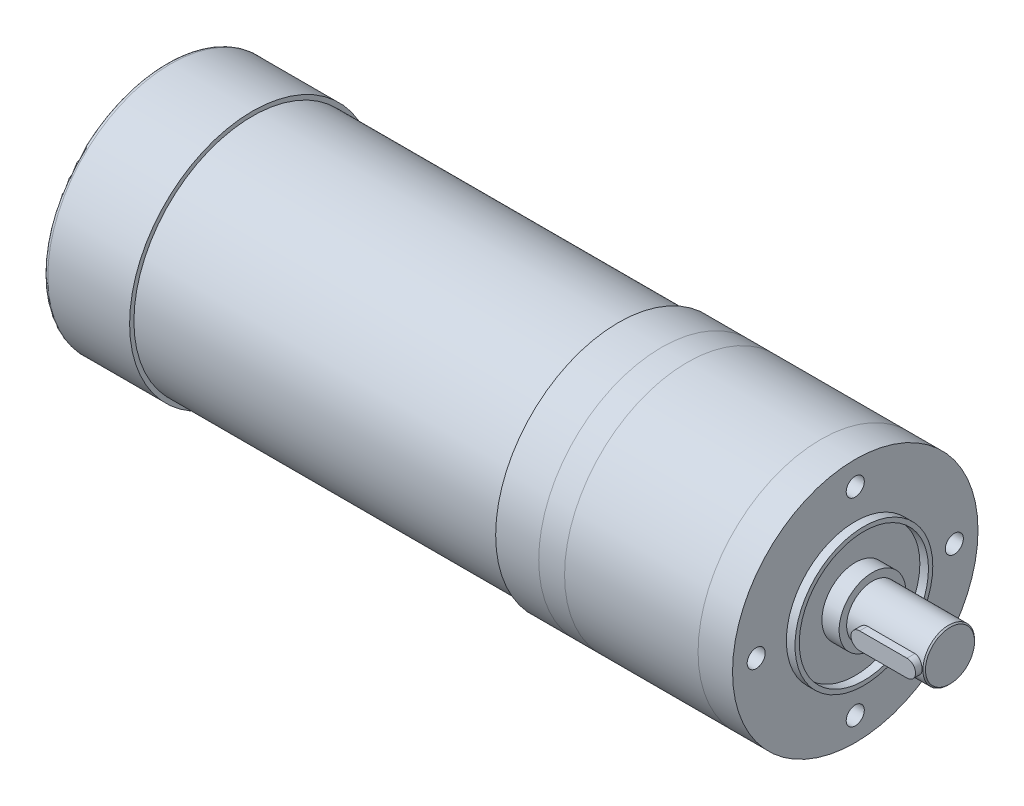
from build123d import *

# Parameters (mm, degrees)
SKETCH_1_R                  = 28.5
EXTRUDE_1_DEPTH             = 8
SKETCH_2_R                  = 28.5
EXTRUDE_2_DEPTH             = 31
SKETCH_3_R                  = 28.5
EXTRUDE_3_DEPTH             = 6
SKETCH_4_R                  = 28.5
EXTRUDE_4_DEPTH             = 10
SKETCH_5_R                  = 27.5
EXTRUDE_5_DEPTH             = 85
SKETCH_6_R                  = 28.5
EXTRUDE_6_DEPTH             = 20
FILLET_1_R                  = 1
SKETCH_7_R                  = 16
SKETCH_7_R_2                = 15
EXTRUDE_7_DEPTH             = 2
SKETCH_8_R                  = 7.75
EXTRUDE_8_DEPTH             = 4
SKETCH_9_R                  = 6
EXTRUDE_9_DEPTH             = 18
HOLE_WIZARD_M5_1_AT_2_COUNT = 2
HOLE_WIZARD_M5_1_AT_2_PITCH = 32.526911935
HOLE_WIZARD_M5_1_AT_3_COUNT = 2
HOLE_WIZARD_M5_1_AT_3_PITCH = 46
HOLE_WIZARD_M5_1_AT_4_COUNT = 2
HOLE_WIZARD_M5_1_AT_4_PITCH = 32.526911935
CUT_EXTRUDE_1_DEPTH         = 2.5
EXTRUDE_10_DEPTH            = 4
CHAMFER_1_SIZE              = 0.3


with BuildPart() as part:
    # Sketch 1 → Extrude 1 (new body)
    with BuildSketch(Plane(origin=(0, 0, 0), x_dir=(0, 0, -1), z_dir=(1, 0, 0))):
        Circle(SKETCH_1_R)
    extrude(amount=-EXTRUDE_1_DEPTH)

    # Sketch 7 → Extrude 7 (add)
    with BuildSketch(Plane(origin=(0, 0, 0), x_dir=(0, 0, -1), z_dir=(1, 0, 0))):
        Circle(SKETCH_7_R)
        Circle(SKETCH_7_R_2, mode=Mode.SUBTRACT)
    extrude(amount=EXTRUDE_7_DEPTH)

    # Sketch 8 → Extrude 8 (add)
    with BuildSketch(Plane(origin=(0, 0, 0), x_dir=(0, 0, -1), z_dir=(1, 0, 0))):
        Circle(SKETCH_8_R)
    extrude(amount=EXTRUDE_8_DEPTH)

    # Sketch 9 → Extrude 9 (add)
    with BuildSketch(Plane(origin=(4, 0, 0), x_dir=(0, 0, -1), z_dir=(1, 0, 0))):
        Circle(SKETCH_9_R)
    extrude(amount=EXTRUDE_9_DEPTH)


with BuildPart() as body_2:
    # Sketch 2 → Extrude 2 (new body)
    with BuildSketch(Plane.ZY.offset(8)):
        Circle(SKETCH_2_R)
    extrude(amount=EXTRUDE_2_DEPTH)


with BuildPart() as body_3:
    # Sketch 3 → Extrude 3 (new body)
    with BuildSketch(Plane.ZY.offset(39)):
        Circle(SKETCH_3_R)
    extrude(amount=EXTRUDE_3_DEPTH)


with BuildPart() as body_4:
    # Sketch 4 → Extrude 4 (new body)
    with BuildSketch(Plane.ZY.offset(45)):
        Circle(SKETCH_4_R)
    extrude(amount=EXTRUDE_4_DEPTH)

    # Sketch 5 → Extrude 5 (add)
    with BuildSketch(Plane.ZY.offset(55)):
        Circle(SKETCH_5_R)
    extrude(amount=EXTRUDE_5_DEPTH)

    # Sketch 6 → Extrude 6 (add)
    with BuildSketch(Plane.ZY.offset(140)):
        Circle(SKETCH_6_R)
    extrude(amount=EXTRUDE_6_DEPTH)

    # Fillet 1
    fillet_1_edges = [body_4.edges().sort_by_distance(p)[0] for p in [
        (-160, 0, -28.5),
    ]]
    fillet(fillet_1_edges, radius=FILLET_1_R)


with BuildPart() as hole_wizard_m5_1_tool:
    # Sketch 11 → Hole Wizard M5 _1 (revolve)
    with BuildSketch(Plane(origin=(0, 23, 0), x_dir=(0, 0, -1), z_dir=(0, 1, 0))):
        Polygon((0, 0), (0, 15.2618073), (2.1, 14), (2.1, 0), align=None)
    hole_wizard_m5_1 = revolve(axis=Axis((6.35, 23, 0), (-1, 0, 0)))


with BuildPart() as part_1:
    add(part.part)

    # Hole Wizard M5 _1: cut by hole_wizard_m5_1_tool
    add(hole_wizard_m5_1_tool.part, mode=Mode.SUBTRACT)


with BuildPart() as body_2_1:
    add(body_2.part)

    # Hole Wizard M5 _1: cut by hole_wizard_m5_1_tool
    add(hole_wizard_m5_1_tool.part, mode=Mode.SUBTRACT)


with BuildPart() as hole_wizard_m5_1_at_2_tool:
    # Hole Wizard M5 _1 at 2: Hole Wizard M5 _1 ×2
    with Locations(*[Vector(0, -0.7071067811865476, -0.7071067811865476) * (i * HOLE_WIZARD_M5_1_AT_2_PITCH) for i in range(1, HOLE_WIZARD_M5_1_AT_2_COUNT)]):
        add(hole_wizard_m5_1)


with BuildPart() as part_2:
    add(part_1.part)

    # Hole Wizard M5 _1 at 2: cut by hole_wizard_m5_1_at_2_tool
    add(hole_wizard_m5_1_at_2_tool.part, mode=Mode.SUBTRACT)


with BuildPart() as body_2_2:
    add(body_2_1.part)

    # Hole Wizard M5 _1 at 2: cut by hole_wizard_m5_1_at_2_tool
    add(hole_wizard_m5_1_at_2_tool.part, mode=Mode.SUBTRACT)


with BuildPart() as hole_wizard_m5_1_at_3_tool:
    # Hole Wizard M5 _1 at 3: Hole Wizard M5 _1 ×2
    with Locations(*[(0, -i * HOLE_WIZARD_M5_1_AT_3_PITCH, 0) for i in range(1, HOLE_WIZARD_M5_1_AT_3_COUNT)]):
        add(hole_wizard_m5_1)


with BuildPart() as part_3:
    add(part_2.part)

    # Hole Wizard M5 _1 at 3: cut by hole_wizard_m5_1_at_3_tool
    add(hole_wizard_m5_1_at_3_tool.part, mode=Mode.SUBTRACT)


with BuildPart() as body_2_3:
    add(body_2_2.part)

    # Hole Wizard M5 _1 at 3: cut by hole_wizard_m5_1_at_3_tool
    add(hole_wizard_m5_1_at_3_tool.part, mode=Mode.SUBTRACT)


with BuildPart() as hole_wizard_m5_1_at_4_tool:
    # Hole Wizard M5 _1 at 4: Hole Wizard M5 _1 ×2
    with Locations(*[Vector(0, -0.7071067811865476, 0.7071067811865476) * (i * HOLE_WIZARD_M5_1_AT_4_PITCH) for i in range(1, HOLE_WIZARD_M5_1_AT_4_COUNT)]):
        add(hole_wizard_m5_1)


with BuildPart() as part_4:
    add(part_3.part)

    # Hole Wizard M5 _1 at 4: cut by hole_wizard_m5_1_at_4_tool
    add(hole_wizard_m5_1_at_4_tool.part, mode=Mode.SUBTRACT)

    # Sketch 12 → Cut-Extrude 1 (cut)
    with BuildSketch(Plane.XY.offset(6)):
        with BuildLine():
            Line((8.5, 2), (19.5, 2))
            ThreePointArc((19.5, 2), (21.5, 0), (19.5, -2))
            Line((19.5, -2), (8.5, -2))
            ThreePointArc((8.5, -2), (6.5, 0), (8.5, 2))
        make_face()
    extrude(amount=-CUT_EXTRUDE_1_DEPTH, mode=Mode.SUBTRACT)

    # Chamfer 1
    chamfer_1_edges = [part_4.edges().sort_by_distance(p)[0] for p in [
        (22, 0, 6),
    ]]
    chamfer(chamfer_1_edges, length=CHAMFER_1_SIZE)


with BuildPart() as body_2_4:
    add(body_2_3.part)

    # Hole Wizard M5 _1 at 4: cut by hole_wizard_m5_1_at_4_tool
    add(hole_wizard_m5_1_at_4_tool.part, mode=Mode.SUBTRACT)


with BuildPart() as body_5:
    # Sketch 13 → Extrude 10 (new body)
    with BuildSketch(Plane.XY.offset(3.5)):
        with BuildLine():
            Line((8.5, 2), (19.5, 2))
            ThreePointArc((19.5, 2), (21.5, 0), (19.5, -2))
            Line((19.5, -2), (8.5, -2))
            ThreePointArc((8.5, -2), (6.5, 0), (8.5, 2))
        make_face()
    extrude(amount=EXTRUDE_10_DEPTH)


solid = Compound([body_3.part, body_4.part, part_4.part, body_2_4.part, body_5.part])
